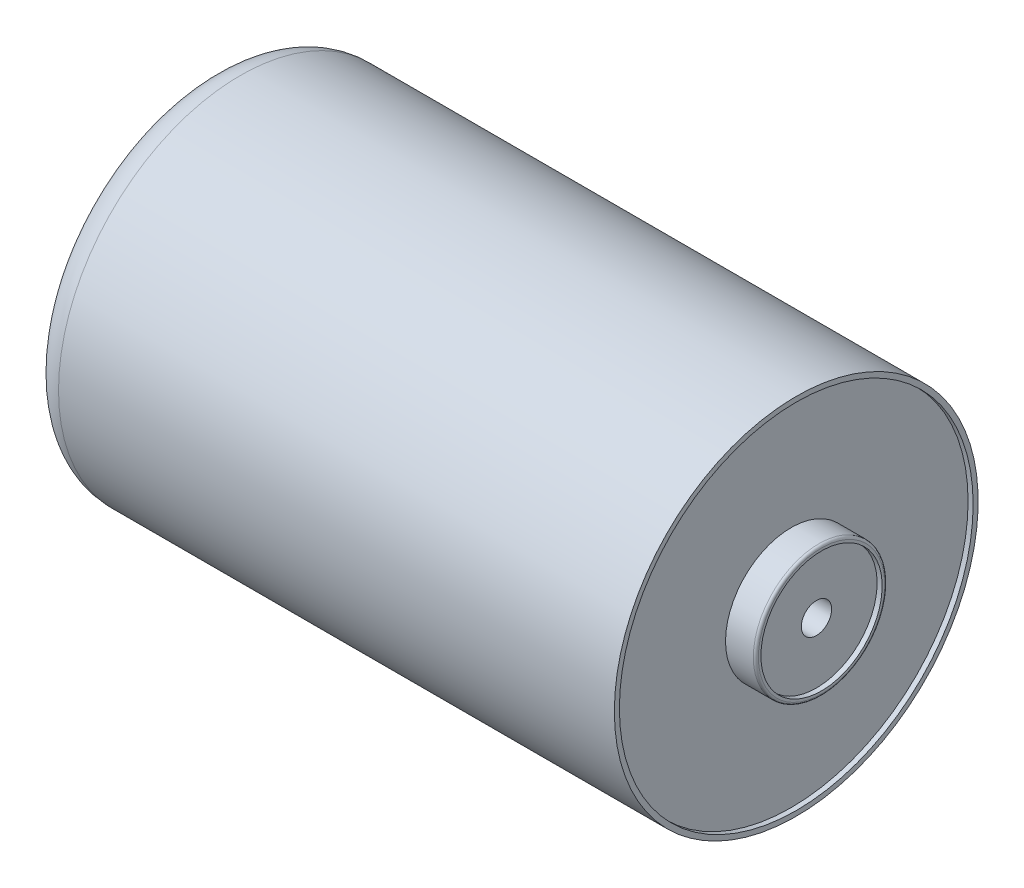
from build123d import *

# Parameters (mm, degrees)
CONG_1_R                = 0.25
CONG_2_R                = 3
ESQUISSE2_R             = 1
ENL_V_MAT_EXTRU_1_DEPTH = 10


with BuildPart() as part:
    # Esquisse1 → R_volution1 (revolve)
    with BuildSketch(Plane.XY, mode=Mode.PRIVATE) as r_volution1_sk:
        Polygon((15.571393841, 1.5), (6.47350081, 1.5), (6.47350081, 6), (5.97350081, 6), (5.97350081, 6.5), (10.47350081, 6.5), (10.47350081, 18), (68.47350081, 18), (68.47350081, 17.502971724), (67.97350081, 17.502971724), (67.97350081, 6.5), (70.97350081, 6.5), (70.97350081, 6), (70.47350081, 6), (70.47350081, 1.5), align=None)
    revolve(r_volution1_sk.sketch.rotate(Axis((0, 0, 0), (1, 0, 0)), 90), axis=Axis((0, 0, 0), (1, 0, 0)))

    # Cong_1
    cong_1_edges = [part.edges().sort_by_distance(p)[0] for p in [
        (70.97350081, 0, -6.5),
        (10.47350081, 0, -6.5),
        (5.97350081, 0, -6.5),
    ]]
    fillet(cong_1_edges, radius=CONG_1_R)

    # Cong_2
    cong_2_edges = [part.edges().sort_by_distance(p)[0] for p in [
        (10.47350081, 0, -18),
    ]]
    fillet(cong_2_edges, radius=CONG_2_R)

    # Esquisse2 → Enl_v. mat.-Extru.1 (cut)
    with BuildSketch(Plane.ZY.offset(-10.47350081)):
        with Locations((12.5, 0)):
            Circle(ESQUISSE2_R)
        with Locations(Location((-12.5, 0, 0), (0, 0, 180))):
            Circle(ESQUISSE2_R)
    extrude(amount=-ENL_V_MAT_EXTRU_1_DEPTH, mode=Mode.SUBTRACT)


solid = part.part
